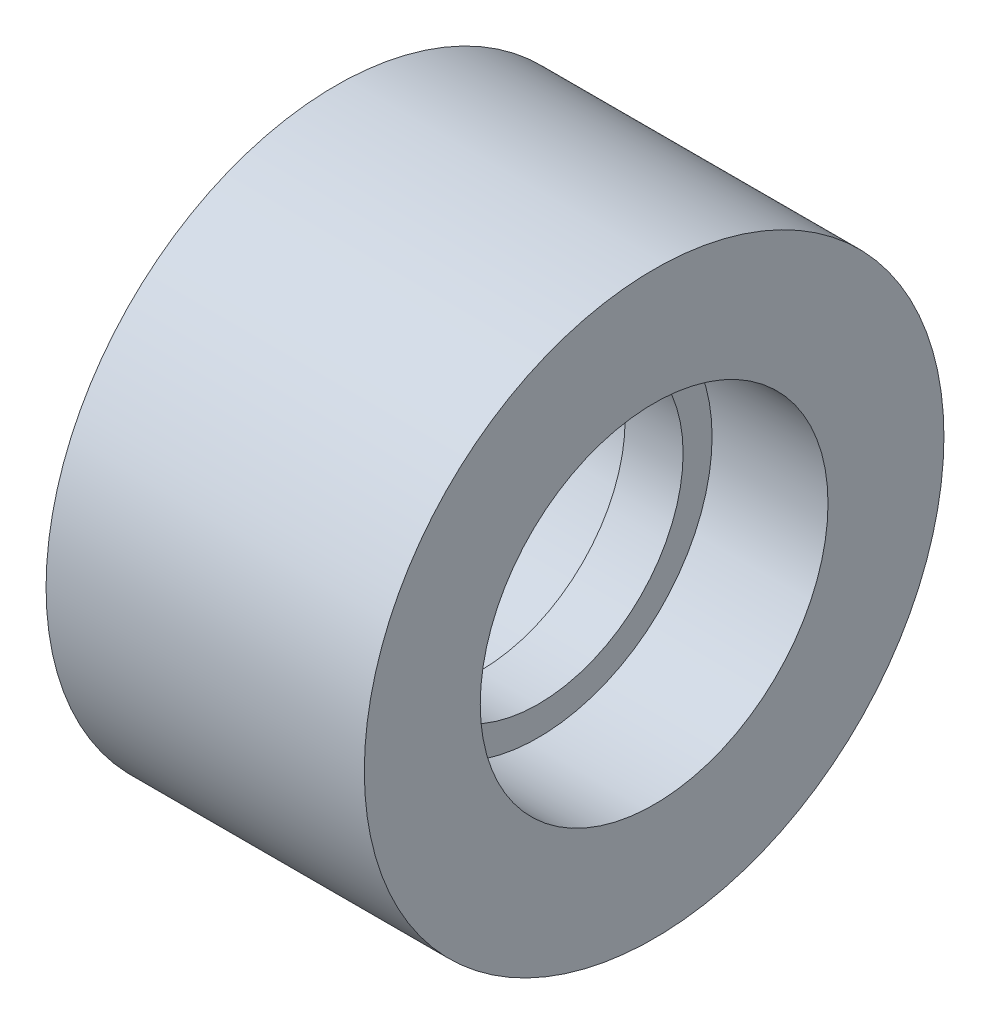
from build123d import *


with BuildPart() as part:
    # Esquisse1 → R_volution1 (revolve)
    with BuildSketch(Plane.XY, mode=Mode.PRIVATE) as r_volution1_sk:
        Polygon((0, 0), (0, 3.6), (0.509558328, 5), (6, 5), (6, 3), (4, 3), (4, 2.5), (3, 2.5), (3, 3), (1, 3), (1, 0), align=None)
    revolve(r_volution1_sk.sketch.rotate(Axis((-17.948180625, 0, 0), (1, 0, 0)), 90), axis=Axis((-17.948180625, 0, 0), (1, 0, 0)))


solid = part.part
